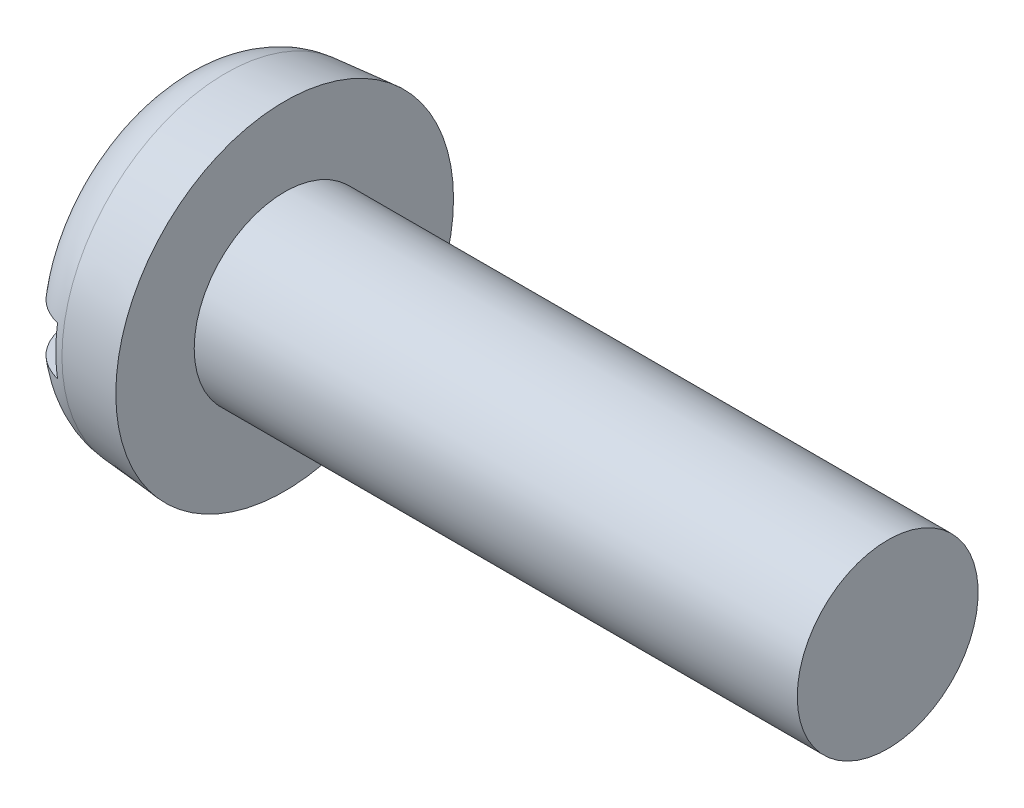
from build123d import *

# Parameters (mm, degrees)
FILLET2_R  = 0.9
SKETCH2_W  = 5.6
SKETCH2_H  = 0.8
SLOT_DEPTH = 0.7


with BuildPart() as part:
    # BodySke → Base-Revolve (revolve)
    with BuildSketch(Plane.XY, mode=Mode.PRIVATE) as base_revolve_sk:
        Polygon((1.8, 1.5), (1.8, 2.8), (0, 2.642520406), (0, 0), (11.8, 0), (11.8, 1.5), align=None)
    revolve(base_revolve_sk.sketch.rotate(Axis((-25.4, 0, 0), (1, 0, 0)), 90), axis=Axis((-25.4, 0, 0), (1, 0, 0)))

    # Fillet2
    fillet2_edges = [part.edges().sort_by_distance(p)[0] for p in [
        (0, 0, -2.642520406),
    ]]
    fillet(fillet2_edges, radius=FILLET2_R)

    # Sketch2 → Slot (cut)
    with BuildSketch(Plane(origin=(0, 0, 0), x_dir=(0, 0, -1), z_dir=(1, 0, 0))):
        Rectangle(SKETCH2_W, SKETCH2_H)
    extrude(amount=SLOT_DEPTH, mode=Mode.SUBTRACT)


solid = part.part
